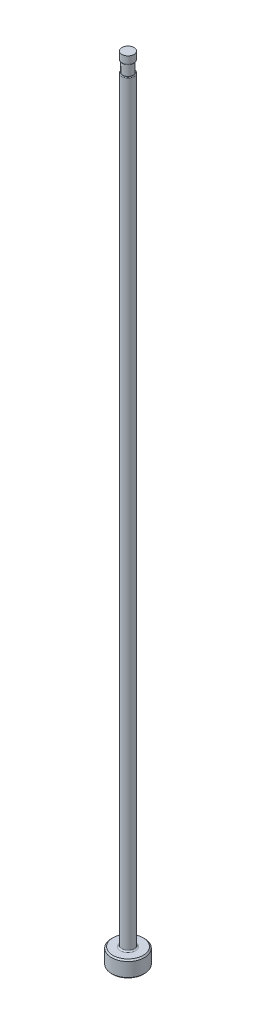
from build123d import *

# Parameters (mm, degrees)
CHAMFER1_SIZE     = 0.254
FILLET1_R         = 0.254
SKETCH2_W         = 0.2032
SKETCH2_H         = 2.032
D_SLOT_DEPTH      = 153.466131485
D_SLOT_DEPTH_BACK = 153.466131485
SKETCH5_W         = 0.0254
SKETCH5_H         = 1.524
FILLET2_R         = 0.127


with BuildPart() as part:
    # Sketch1 → Revolve1 (revolve)
    with BuildSketch(Plane.XY, mode=Mode.PRIVATE) as revolve1_sk:
        Polygon((0, 0), (-3.175, 0), (-3.175, 3.175), (-1.18999, 3.175), (-1.18999, 152.4), (0, 152.4), align=None)
    revolve(revolve1_sk.sketch.rotate(Axis((0, 259.958771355, 0), (0, -1, 0)), 270), axis=Axis((0, 259.958771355, 0), (0, -1, 0)))

    # Chamfer1
    chamfer1_edges = [part.edges().sort_by_distance(p)[0] for p in [
        (0, 3.175, -3.175),
        (0, 0, -3.175),
    ]]
    chamfer(chamfer1_edges, length=CHAMFER1_SIZE)

    # Fillet1
    fillet1_edges = [part.edges().sort_by_distance(p)[0] for p in [
        (0, 3.175, -1.18999),
    ]]
    fillet(fillet1_edges, radius=FILLET1_R)

    # Sketch2 → Vent Relief (revolve, cut)
    with BuildSketch(Plane.XY, mode=Mode.PRIVATE) as vent_relief_sk:
        with Locations((-1.08839, 149.86)):
            Rectangle(SKETCH2_W, SKETCH2_H)
    revolve(vent_relief_sk.sketch.rotate(Axis((0, 153.448281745, 0), (0, -1, 0)), 270), axis=Axis((0, 153.448281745, 0), (0, -1, 0)), mode=Mode.SUBTRACT)

    # Sketch3 → D-Slot (cut, two sides: drawn at the far end of the back side and taken through both)
    with BuildSketch(Plane.XY.offset(-D_SLOT_DEPTH_BACK)):
        with BuildLine():
            Line((-0.98679, 149.86), (-0.98679, 86.36))
            ThreePointArc((-0.98679, 86.36), (-1.038003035, 85.792038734), (-1.18999, 85.2424))
            Line((-1.18999, 85.2424), (-1.18999, 149.86))
            Line((-1.18999, 149.86), (-0.98679, 149.86))
        make_face()
    extrude(amount=D_SLOT_DEPTH + D_SLOT_DEPTH_BACK, mode=Mode.SUBTRACT)

    # Sketch5 → Vent Diameter (revolve, cut)
    with BuildSketch(Plane.XY, mode=Mode.PRIVATE) as vent_diameter_sk:
        with Locations((-1.17729, 151.638)):
            Rectangle(SKETCH5_W, SKETCH5_H)
    revolve(vent_diameter_sk.sketch.rotate(Axis((0, 152.687735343, 0), (0, -1, 0)), 90), axis=Axis((0, 152.687735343, 0), (0, -1, 0)), mode=Mode.SUBTRACT)

    # Fillet2
    fillet2_edges = [part.edges().sort_by_distance(p)[0] for p in [
        (1.050596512, 148.844, -0.55885881),
        (0, 150.876, 1.16459),
    ]]
    fillet(fillet2_edges, radius=FILLET2_R)


solid = part.part
